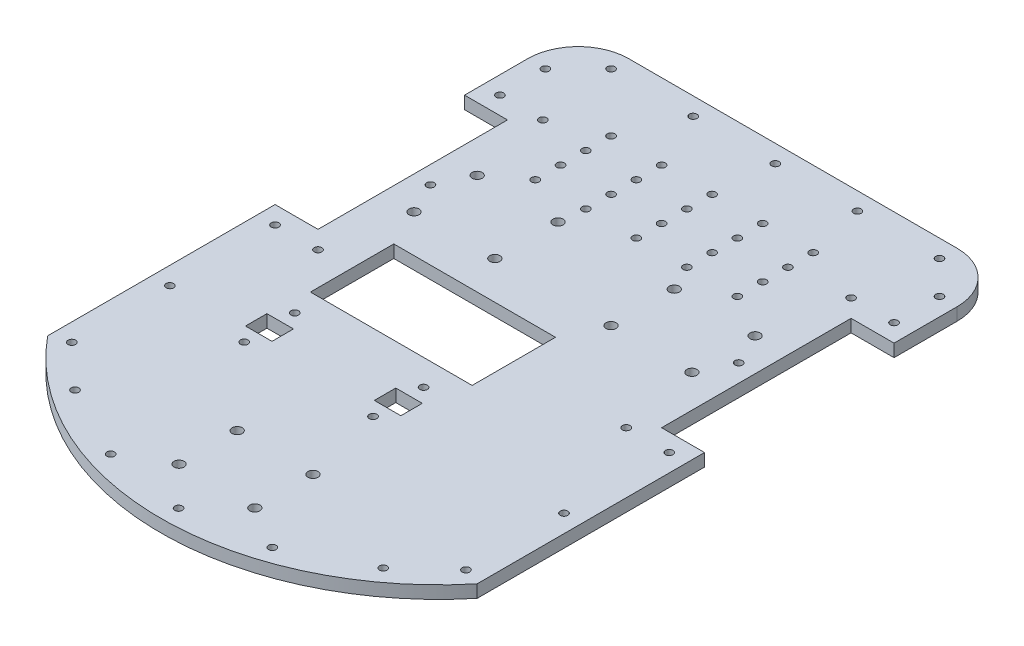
from build123d import *

# Parameters (mm, degrees)
SKETCH1_R            = 2
SKETCH1_W            = 64
SKETCH1_H            = 33
BOSS_EXTRUDE1_DEPTH  = 5
CUT_EXTRUDE2_REACH   = 170.152
SKETCH4_R            = 1.5
SKETCH4_W            = 10.5
SKETCH4_H            = 8.5
SKETCH6_R            = 1.5
CUT_EXTRUDE3_DEPTH   = 169.151717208
CRVPATTERN1_COUNT    = 5
CRVPATTERN1_PITCH    = 32.5
SKETCH7_R            = 1.5
CUT_EXTRUDE4_DEPTH   = 169.151717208
SKETCH8_R            = 1.5
CUT_EXTRUDE5_DEPTH   = 169.151717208
LPATTERN2_COUNT      = 5
LPATTERN2_PITCH      = 20
LPATTERN2_COUNT_DIR2 = 4
LPATTERN2_PITCH_DIR2 = 10


with BuildPart() as part:
    # Sketch1 → Boss-Extrude1 (new body)
    with BuildSketch(Plane(origin=(0, 0, 0), x_dir=(1, 0, 0), z_dir=(0, 1, 0))):
        with BuildLine():
            Line((-65, 145), (65, 145))
            ThreePointArc((65, 145), (79.142135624, 139.142135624), (85, 125))
            Line((85, 125), (85, 100))
            Line((85, 100), (68, 100))
            Line((68, 100), (68, 25))
            Line((68, 25), (85, 25))
            Line((85, 25), (85, -65))
            ThreePointArc((85, -65), (0, -105.178799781), (-85, -65))
            Line((-85, -65), (-85, 25))
            Line((-85, 25), (-68, 25))
            Line((-68, 25), (-68, 100))
            Line((-68, 100), (-85, 100))
            Line((-85, 100), (-85, 125))
            ThreePointArc((-85, 125), (-79.142135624, 139.142135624), (-65, 145))
        make_face()
        with Locations(Location((-23, 50, 0), (0, 0, 270))):
            Circle(SKETCH1_R, mode=Mode.SUBTRACT)
        with Locations(Location((-55, 50, 0), (0, 0, 270))):
            Circle(SKETCH1_R, mode=Mode.SUBTRACT)
        with Locations(Location((-55, 75, 0), (0, 0, 270))):
            Circle(SKETCH1_R, mode=Mode.SUBTRACT)
        with Locations(Location((-23, 75, 0), (0, 0, 270))):
            Circle(SKETCH1_R, mode=Mode.SUBTRACT)
        with Locations(Location((55, 75, 0), (0, 0, 90))):
            Circle(SKETCH1_R, mode=Mode.SUBTRACT)
        with Locations(Location((55, 50, 0), (0, 0, 90))):
            Circle(SKETCH1_R, mode=Mode.SUBTRACT)
        with Locations(Location((23, 75, 0), (0, 0, 90))):
            Circle(SKETCH1_R, mode=Mode.SUBTRACT)
        with Locations(Location((23, 50, 0), (0, 0, 90))):
            Circle(SKETCH1_R, mode=Mode.SUBTRACT)
        with Locations(Location((15, -83, 0), (0, 0, 270))):
            Circle(SKETCH1_R, mode=Mode.SUBTRACT)
        with Locations(Location((-15, -83, 0), (0, 0, 270))):
            Circle(SKETCH1_R, mode=Mode.SUBTRACT)
        with Locations(Location((-15, -60, 0), (0, 0, 270))):
            Circle(SKETCH1_R, mode=Mode.SUBTRACT)
        with Locations(Location((15, -60, 0), (0, 0, 270))):
            Circle(SKETCH1_R, mode=Mode.SUBTRACT)
        with Locations((-16, 18.5)):
            Rectangle(SKETCH1_W, SKETCH1_H, mode=Mode.SUBTRACT)
    extrude(amount=BOSS_EXTRUDE1_DEPTH)

    # Sketch4 → Cut-Extrude2 (cut, up to next)
    with BuildSketch(Plane(origin=(0, 5, 0), x_dir=(1, 0, 0), z_dir=(0, 1, 0)), mode=Mode.PRIVATE) as cut_extrude2_sk1:
        with Locations(Location((-43.96, -28.25, 0), (0, 0, 270))):
            Circle(SKETCH4_R)
    cut_extrude2_tool1 = extrude(cut_extrude2_sk1.sketch, amount=-CUT_EXTRUDE2_REACH, mode=Mode.PRIVATE) & part.part
    # Sketch4 → Cut-Extrude2 (cut, up to next)
    with BuildSketch(Plane(origin=(0, 5, 0), x_dir=(1, 0, 0), z_dir=(0, 1, 0)), mode=Mode.PRIVATE) as cut_extrude2_sk2:
        with Locations(Location((-43.96, -8.25, 0), (0, 0, 270))):
            Circle(SKETCH4_R)
    cut_extrude2_tool2 = extrude(cut_extrude2_sk2.sketch, amount=-CUT_EXTRUDE2_REACH, mode=Mode.PRIVATE) & part.part
    # Sketch4 → Cut-Extrude2 (cut, up to next)
    with BuildSketch(Plane(origin=(0, 5, 0), x_dir=(1, 0, 0), z_dir=(0, 1, 0)), mode=Mode.PRIVATE) as cut_extrude2_sk3:
        with Locations(Location((7.04, -8.25, 0), (0, 0, 270))):
            Circle(SKETCH4_R)
    cut_extrude2_tool3 = extrude(cut_extrude2_sk3.sketch, amount=-CUT_EXTRUDE2_REACH, mode=Mode.PRIVATE) & part.part
    # Sketch4 → Cut-Extrude2 (cut, up to next)
    with BuildSketch(Plane(origin=(0, 5, 0), x_dir=(1, 0, 0), z_dir=(0, 1, 0)), mode=Mode.PRIVATE) as cut_extrude2_sk4:
        with Locations(Location((7.04, -28.25, 0), (0, 0, 270))):
            Circle(SKETCH4_R)
    cut_extrude2_tool4 = extrude(cut_extrude2_sk4.sketch, amount=-CUT_EXTRUDE2_REACH, mode=Mode.PRIVATE) & part.part
    # Sketch4 → Cut-Extrude2 (cut, up to next)
    with BuildSketch(Plane(origin=(0, 5, 0), x_dir=(1, 0, 0), z_dir=(0, 1, 0)), mode=Mode.PRIVATE) as cut_extrude2_sk5:
        with Locations((7.04, -18.25)):
            Rectangle(SKETCH4_W, SKETCH4_H)
    cut_extrude2_tool5 = extrude(cut_extrude2_sk5.sketch, amount=-CUT_EXTRUDE2_REACH, mode=Mode.PRIVATE) & part.part
    # Sketch4 → Cut-Extrude2 (cut, up to next)
    with BuildSketch(Plane(origin=(0, 5, 0), x_dir=(1, 0, 0), z_dir=(0, 1, 0)), mode=Mode.PRIVATE) as cut_extrude2_sk6:
        with Locations((-43.96, -18.25)):
            Rectangle(SKETCH4_W, SKETCH4_H)
    cut_extrude2_tool6 = extrude(cut_extrude2_sk6.sketch, amount=-CUT_EXTRUDE2_REACH, mode=Mode.PRIVATE) & part.part
    add(cut_extrude2_tool1.solids().sort_by_distance((-43.96, 5, 28.25))[0], mode=Mode.SUBTRACT)
    add(cut_extrude2_tool2.solids().sort_by_distance((-43.96, 5, 8.25))[0], mode=Mode.SUBTRACT)
    add(cut_extrude2_tool3.solids().sort_by_distance((7.04, 5, 8.25))[0], mode=Mode.SUBTRACT)
    add(cut_extrude2_tool4.solids().sort_by_distance((7.04, 5, 28.25))[0], mode=Mode.SUBTRACT)
    add(cut_extrude2_tool5.solids().sort_by_distance((7.04, 5, 18.25))[0], mode=Mode.SUBTRACT)
    add(cut_extrude2_tool6.solids().sort_by_distance((-43.96, 5, 18.25))[0], mode=Mode.SUBTRACT)

    # Sketch6 → Cut-Extrude3 (cut, through all)
    with BuildSketch(Plane(origin=(0, 5, 0), x_dir=(1, 0, 0), z_dir=(0, 1, 0))):
        with Locations(Location((-65, 138, 0), (0, 0, 270))):
            Circle(SKETCH6_R)
    cut_extrude3 = extrude(amount=-CUT_EXTRUDE3_DEPTH, mode=Mode.SUBTRACT)

    # CrvPattern1: Cut-Extrude3 ×5
    with Locations(*[(i * CRVPATTERN1_PITCH, 0, 0) for i in range(1, CRVPATTERN1_COUNT)]):
        add(cut_extrude3, mode=Mode.SUBTRACT)

    # Sketch7 → Cut-Extrude4 (cut, through all)
    with BuildSketch(Plane(origin=(0, 5, 0), x_dir=(1, 0, 0), z_dir=(0, 1, 0))):
        with Locations(Location((78, 125, 0), (0, 0, 270))):
            Circle(SKETCH7_R)
        with Locations(Location((78, 107, 0), (0, 0, 270))):
            Circle(SKETCH7_R)
        with Locations(Location((61, 107, 0), (0, 0, 270))):
            Circle(SKETCH7_R)
        with Locations(Location((61, 62.5, 0), (0, 0, 270))):
            Circle(SKETCH7_R)
        with Locations(Location((61, 18, 0), (0, 0, 270))):
            Circle(SKETCH7_R)
        with Locations(Location((78, 18, 0), (0, 0, 270))):
            Circle(SKETCH7_R)
        with Locations(Location((78, -23.622428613, 0), (0, 0, 270))):
            Circle(SKETCH7_R)
        with Locations(Location((78, -62.446920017, 0), (0, 0, 270))):
            Circle(SKETCH7_R)
        with Locations(Location((61, -78.172775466, 0), (0, 0, 270))):
            Circle(SKETCH7_R)
        with Locations(Location((32, -93.081813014, 0), (0, 0, 270))):
            Circle(SKETCH7_R)
        with Locations(Location((0, -98.178799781, 0), (0, 0, 270))):
            Circle(SKETCH7_R)
        with Locations(Location((-32, -93.081813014, 0), (0, 0, 90))):
            Circle(SKETCH7_R)
        with Locations(Location((-61, -78.172775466, 0), (0, 0, 90))):
            Circle(SKETCH7_R)
        with Locations(Location((-78, -62.446920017, 0), (0, 0, 90))):
            Circle(SKETCH7_R)
        with Locations(Location((-61, 18, 0), (0, 0, 90))):
            Circle(SKETCH7_R)
        with Locations(Location((-61, 62.5, 0), (0, 0, 90))):
            Circle(SKETCH7_R)
        with Locations(Location((-61, 107, 0), (0, 0, 90))):
            Circle(SKETCH7_R)
        with Locations(Location((-78, -23.622428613, 0), (0, 0, 90))):
            Circle(SKETCH7_R)
        with Locations(Location((-78, 18, 0), (0, 0, 90))):
            Circle(SKETCH7_R)
        with Locations(Location((-78, 107, 0), (0, 0, 90))):
            Circle(SKETCH7_R)
        with Locations(Location((-78, 125, 0), (0, 0, 90))):
            Circle(SKETCH7_R)
    extrude(amount=-CUT_EXTRUDE4_DEPTH, mode=Mode.SUBTRACT)

    # Sketch8 → Cut-Extrude5 (cut, through all)
    with BuildSketch(Plane.XZ):
        with Locations(Location((38, -115, 0), (0, 0, 270))):
            Circle(SKETCH8_R)
    cut_extrude5 = extrude(amount=-CUT_EXTRUDE5_DEPTH, mode=Mode.SUBTRACT)

    # LPattern2: Cut-Extrude5 5 × 4
    with Locations(*[(-i * LPATTERN2_PITCH, 0, j * LPATTERN2_PITCH_DIR2) for i in range(LPATTERN2_COUNT) for j in range(LPATTERN2_COUNT_DIR2) if (i, j) != (0, 0)]):
        add(cut_extrude5, mode=Mode.SUBTRACT)


solid = part.part
